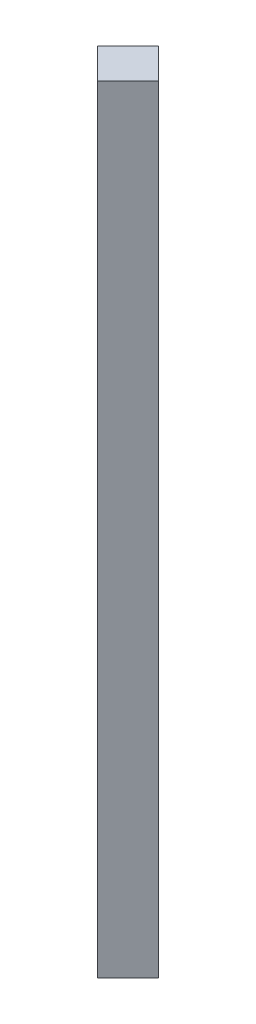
ISO-10303-21;
HEADER;
FILE_DESCRIPTION(('STEP AP214'),'2;1');
FILE_NAME('part.step','',(''),(''),'','','');
FILE_SCHEMA(('AUTOMOTIVE_DESIGN { 1 0 10303 214 1 1 1 1 }'));
ENDSEC;
DATA;
#1=APPLICATION_CONTEXT('core data for automotive mechanical design processes');
#2=APPLICATION_PROTOCOL_DEFINITION('international standard','automotive_design',2000,#1);
#3=PRODUCT_CONTEXT('',#1,'mechanical');
#4=PRODUCT('Part','Part','',(#3));
#5=PRODUCT_RELATED_PRODUCT_CATEGORY('part','',(#4));
#6=PRODUCT_DEFINITION_FORMATION('','',#4);
#7=PRODUCT_DEFINITION_CONTEXT('part definition',#1,'design');
#8=PRODUCT_DEFINITION('design','',#6,#7);
#9=PRODUCT_DEFINITION_SHAPE('','',#8);
#10=(LENGTH_UNIT() NAMED_UNIT(*) SI_UNIT(.MILLI.,.METRE.));
#11=(NAMED_UNIT(*) PLANE_ANGLE_UNIT() SI_UNIT($,.RADIAN.));
#12=(NAMED_UNIT(*) SI_UNIT($,.STERADIAN.) SOLID_ANGLE_UNIT());
#13=UNCERTAINTY_MEASURE_WITH_UNIT(LENGTH_MEASURE(1.E-05),#10,'distance_accuracy_value','');
#14=(GEOMETRIC_REPRESENTATION_CONTEXT(3) GLOBAL_UNCERTAINTY_ASSIGNED_CONTEXT((#13)) GLOBAL_UNIT_ASSIGNED_CONTEXT((#10,
#11,#12)) REPRESENTATION_CONTEXT('',''));
#15=CARTESIAN_POINT('',(0.,0.,0.));
#16=DIRECTION('',(0.,0.,1.));
#17=DIRECTION('',(1.,0.,0.));
#18=AXIS2_PLACEMENT_3D('',#15,#16,#17);
#19=CARTESIAN_POINT('',(321.462124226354,-70.1791871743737,114.197745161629));
#20=DIRECTION('',(0.707106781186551,0.,0.707106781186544));
#21=DIRECTION('',(0.707106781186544,0.,-0.707106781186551));
#22=AXIS2_PLACEMENT_3D('',#19,#20,#21);
#23=PLANE('',#22);
#24=DIRECTION('',(0.,1.,0.));
#25=VECTOR('',#24,1.);
#26=CARTESIAN_POINT('',(322.522784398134,-70.1791871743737,113.137084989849));
#27=LINE('',#26,#25);
#28=CARTESIAN_POINT('',(322.522784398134,-70.1791871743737,113.137084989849));
#29=VERTEX_POINT('',#28);
#30=CARTESIAN_POINT('',(322.522784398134,-97.1791871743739,113.137084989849));
#31=VERTEX_POINT('',#30);
#32=EDGE_CURVE('E54',#29,#31,#27,.F.);
#33=ORIENTED_EDGE('',*,*,#32,.F.);
#34=DIRECTION('',(0.70710678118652,0.,-0.707106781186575));
#35=VECTOR('',#34,1.);
#36=CARTESIAN_POINT('',(321.462124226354,-70.1791871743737,114.197745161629));
#37=LINE('',#36,#35);
#38=CARTESIAN_POINT('',(321.462124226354,-70.1791871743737,114.197745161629));
#39=VERTEX_POINT('',#38);
#40=EDGE_CURVE('E67',#39,#29,#37,.T.);
#41=ORIENTED_EDGE('',*,*,#40,.F.);
#42=DIRECTION('',(0.,1.,0.));
#43=VECTOR('',#42,1.);
#44=CARTESIAN_POINT('',(321.462124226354,-70.1791871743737,114.197745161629));
#45=LINE('',#44,#43);
#46=CARTESIAN_POINT('',(321.462124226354,-97.1791871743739,114.197745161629));
#47=VERTEX_POINT('',#46);
#48=EDGE_CURVE('E60',#39,#47,#45,.F.);
#49=ORIENTED_EDGE('',*,*,#48,.T.);
#50=DIRECTION('',(0.707106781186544,0.,-0.707106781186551));
#51=VECTOR('',#50,1.);
#52=CARTESIAN_POINT('',(321.462124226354,-97.1791871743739,114.197745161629));
#53=LINE('',#52,#51);
#54=EDGE_CURVE('E19',#47,#31,#53,.T.);
#55=ORIENTED_EDGE('',*,*,#54,.T.);
#56=EDGE_LOOP('',(#33,#41,#49,#55));
#57=FACE_BOUND('',#56,.T.);
#58=ADVANCED_FACE('F16',(#57),#23,.T.);
#59=CARTESIAN_POINT('',(320.401464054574,-70.1791871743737,113.137084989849));
#60=DIRECTION('',(0.707106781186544,0.,-0.707106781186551));
#61=DIRECTION('',(-0.707106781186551,0.,-0.707106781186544));
#62=AXIS2_PLACEMENT_3D('',#59,#60,#61);
#63=PLANE('',#62);
#64=ORIENTED_EDGE('',*,*,#48,.F.);
#65=DIRECTION('',(0.707106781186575,0.,0.70710678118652));
#66=VECTOR('',#65,1.);
#67=CARTESIAN_POINT('',(320.401464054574,-70.1791871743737,113.137084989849));
#68=LINE('',#67,#66);
#69=CARTESIAN_POINT('',(320.401464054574,-70.1791871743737,113.137084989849));
#70=VERTEX_POINT('',#69);
#71=EDGE_CURVE('E63',#70,#39,#68,.T.);
#72=ORIENTED_EDGE('',*,*,#71,.F.);
#73=DIRECTION('',(0.,1.,0.));
#74=VECTOR('',#73,1.);
#75=CARTESIAN_POINT('',(320.401464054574,-97.1791871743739,113.137084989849));
#76=LINE('',#75,#74);
#77=CARTESIAN_POINT('',(320.401464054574,-97.1791871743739,113.137084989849));
#78=VERTEX_POINT('',#77);
#79=EDGE_CURVE('E82',#78,#70,#76,.T.);
#80=ORIENTED_EDGE('',*,*,#79,.F.);
#81=DIRECTION('',(-0.707106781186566,0.,-0.707106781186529));
#82=VECTOR('',#81,1.);
#83=CARTESIAN_POINT('',(321.462124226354,-97.1791871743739,114.197745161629));
#84=LINE('',#83,#82);
#85=EDGE_CURVE('E66',#47,#78,#84,.T.);
#86=ORIENTED_EDGE('',*,*,#85,.F.);
#87=EDGE_LOOP('',(#64,#72,#80,#86));
#88=FACE_BOUND('',#87,.T.);
#89=ADVANCED_FACE('F61',(#88),#63,.F.);
#90=CARTESIAN_POINT('',(320.401464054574,-70.1791871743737,113.137084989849));
#91=DIRECTION('',(0.,1.,0.));
#92=DIRECTION('',(-1.,0.,0.));
#93=AXIS2_PLACEMENT_3D('',#90,#91,#92);
#94=PLANE('',#93);
#95=DIRECTION('',(-0.707106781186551,0.,-0.707106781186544));
#96=VECTOR('',#95,1.);
#97=CARTESIAN_POINT('',(321.462124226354,-70.1791871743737,112.076424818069));
#98=LINE('',#97,#96);
#99=CARTESIAN_POINT('',(321.462124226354,-70.1791871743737,112.076424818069));
#100=VERTEX_POINT('',#99);
#101=EDGE_CURVE('E78',#100,#29,#98,.F.);
#102=ORIENTED_EDGE('',*,*,#101,.F.);
#103=DIRECTION('',(-0.707106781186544,0.,0.707106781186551));
#104=VECTOR('',#103,1.);
#105=CARTESIAN_POINT('',(320.401464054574,-70.1791871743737,113.137084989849));
#106=LINE('',#105,#104);
#107=EDGE_CURVE('E73',#70,#100,#106,.F.);
#108=ORIENTED_EDGE('',*,*,#107,.F.);
#109=ORIENTED_EDGE('',*,*,#71,.T.);
#110=ORIENTED_EDGE('',*,*,#40,.T.);
#111=EDGE_LOOP('',(#102,#108,#109,#110));
#112=FACE_BOUND('',#111,.T.);
#113=ADVANCED_FACE('F71',(#112),#94,.T.);
#114=CARTESIAN_POINT('',(321.462124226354,-70.1791871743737,112.076424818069));
#115=DIRECTION('',(0.707106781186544,0.,-0.707106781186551));
#116=DIRECTION('',(-0.707106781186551,0.,-0.707106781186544));
#117=AXIS2_PLACEMENT_3D('',#114,#115,#116);
#118=PLANE('',#117);
#119=DIRECTION('',(0.,1.,0.));
#120=VECTOR('',#119,1.);
#121=CARTESIAN_POINT('',(321.462124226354,-97.1791871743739,112.076424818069));
#122=LINE('',#121,#120);
#123=CARTESIAN_POINT('',(321.462124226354,-97.1791871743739,112.076424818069));
#124=VERTEX_POINT('',#123);
#125=EDGE_CURVE('E25',#100,#124,#122,.F.);
#126=ORIENTED_EDGE('',*,*,#125,.F.);
#127=ORIENTED_EDGE('',*,*,#101,.T.);
#128=ORIENTED_EDGE('',*,*,#32,.T.);
#129=DIRECTION('',(0.707106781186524,0.,0.707106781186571));
#130=VECTOR('',#129,1.);
#131=CARTESIAN_POINT('',(321.462124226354,-97.1791871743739,112.076424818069));
#132=LINE('',#131,#130);
#133=EDGE_CURVE('E34',#124,#31,#132,.T.);
#134=ORIENTED_EDGE('',*,*,#133,.F.);
#135=EDGE_LOOP('',(#126,#127,#128,#134));
#136=FACE_BOUND('',#135,.T.);
#137=ADVANCED_FACE('F88',(#136),#118,.T.);
#138=CARTESIAN_POINT('',(321.462124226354,-97.1791871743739,114.197745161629));
#139=DIRECTION('',(0.,-1.,0.));
#140=DIRECTION('',(1.,0.,0.));
#141=AXIS2_PLACEMENT_3D('',#138,#139,#140);
#142=PLANE('',#141);
#143=ORIENTED_EDGE('',*,*,#133,.T.);
#144=ORIENTED_EDGE('',*,*,#54,.F.);
#145=ORIENTED_EDGE('',*,*,#85,.T.);
#146=DIRECTION('',(-0.707106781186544,0.,0.707106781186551));
#147=VECTOR('',#146,1.);
#148=CARTESIAN_POINT('',(320.401464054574,-97.1791871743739,113.137084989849));
#149=LINE('',#148,#147);
#150=EDGE_CURVE('E11',#124,#78,#149,.T.);
#151=ORIENTED_EDGE('',*,*,#150,.F.);
#152=EDGE_LOOP('',(#143,#144,#145,#151));
#153=FACE_BOUND('',#152,.T.);
#154=ADVANCED_FACE('F90',(#153),#142,.T.);
#155=CARTESIAN_POINT('',(320.401464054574,-97.1791871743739,113.137084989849));
#156=DIRECTION('',(-0.707106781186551,0.,-0.707106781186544));
#157=DIRECTION('',(-0.707106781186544,0.,0.707106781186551));
#158=AXIS2_PLACEMENT_3D('',#155,#156,#157);
#159=PLANE('',#158);
#160=ORIENTED_EDGE('',*,*,#125,.T.);
#161=ORIENTED_EDGE('',*,*,#150,.T.);
#162=ORIENTED_EDGE('',*,*,#79,.T.);
#163=ORIENTED_EDGE('',*,*,#107,.T.);
#164=EDGE_LOOP('',(#160,#161,#162,#163));
#165=FACE_BOUND('',#164,.T.);
#166=ADVANCED_FACE('F87',(#165),#159,.T.);
#167=CLOSED_SHELL('',(#58,#89,#113,#137,#154,#166));
#168=MANIFOLD_SOLID_BREP('B1',#167);
#169=ADVANCED_BREP_SHAPE_REPRESENTATION('',(#18,#168),#14);
#170=SHAPE_DEFINITION_REPRESENTATION(#9,#169);
ENDSEC;
END-ISO-10303-21;
